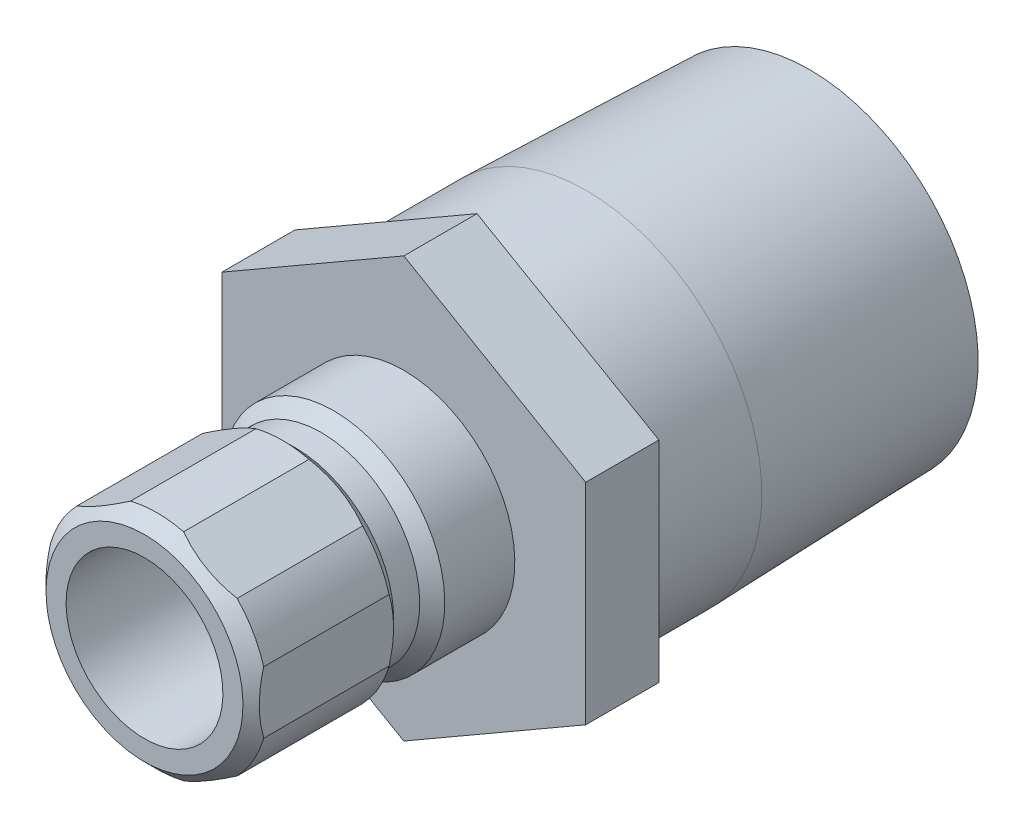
from build123d import *

# Parameters (mm, degrees)
SKETCH2_R           = 7.8994
BOSS_EXTRUDE1_DEPTH = 4.445
CUT_EXTRUDE1_START  = 6.604
SKETCH3_OUTSIDE_W   = 34.626
SKETCH3_OUTSIDE_H   = 38.044
CUT_EXTRUDE1_DEPTH  = 24.260448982


with BuildPart() as part:
    # Sketch1 → Revolve1 (revolve)
    with BuildSketch(Plane(origin=(0, 0, 0), x_dir=(0, 0, -1), z_dir=(1, 0, 0))):
        Polygon((-15.748, 4.7625), (-15.748, 5.9817), (-14.986, 6.7437), (-7.366, 6.7437), (-6.604, 5.9817), (-5.0165, 5.9817), (-4.2545, 6.7437), (0, 6.7437), (0, 10.668), (11.0744, 10.668), (24.638, 10.244140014), (24.638, 7.8994), (3.191919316, 7.8994), (1.524, 4.7625), align=None)
    revolve(axis=Axis((0, 0, 0), (0, 0, 1)))

    # Sketch2 → Boss-Extrude1 (add)
    with BuildSketch(Plane.XY):
        Polygon((-11.049, 6.379143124), (-11.049, -6.379143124), (0, -12.758286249), (11.049, -6.379143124), (11.049, 6.379143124), (0, 12.758286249), align=None)
        with Locations(Location((0, 0, 0), (0, 0, 90))):
            Circle(SKETCH2_R, mode=Mode.SUBTRACT)
    extrude(amount=-BOSS_EXTRUDE1_DEPTH)

    # Sketch3 outside → Cut-Extrude1 (cut, through all)
    with BuildSketch(Plane.XY.offset(CUT_EXTRUDE1_START)):
        Rectangle(SKETCH3_OUTSIDE_W, SKETCH3_OUTSIDE_H)
        Polygon((-6.477, 3.739497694), (-6.477, -3.739497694), (0, -7.478995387), (6.477, -3.739497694), (6.477, 3.739497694), (0, 7.478995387), align=None, mode=Mode.SUBTRACT)
    extrude(amount=CUT_EXTRUDE1_DEPTH, mode=Mode.SUBTRACT)


solid = part.part
